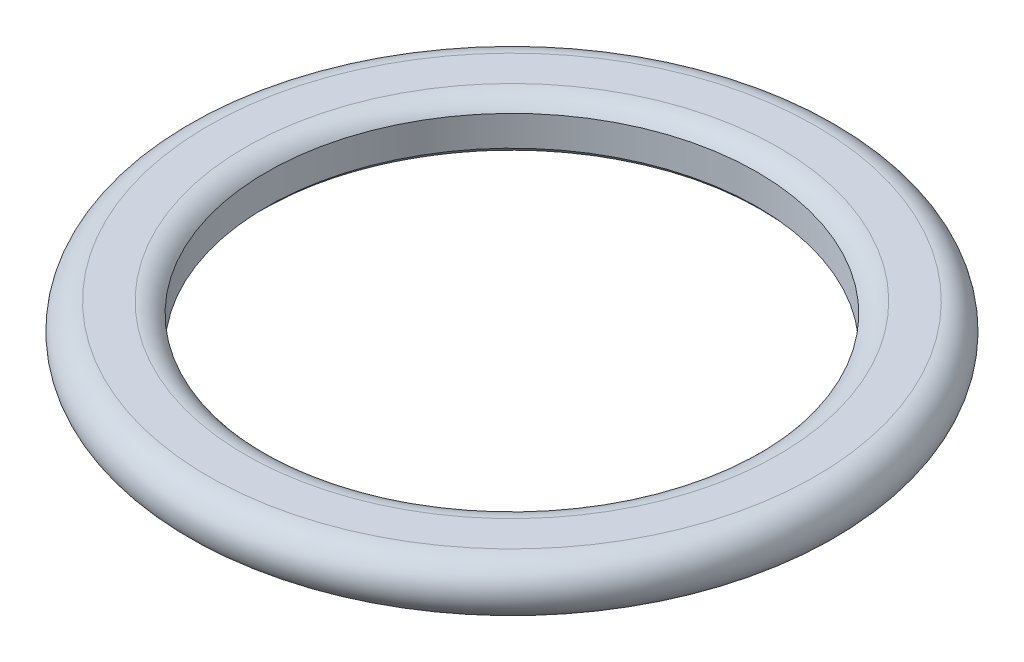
ISO-10303-21;
HEADER;
FILE_DESCRIPTION(('STEP AP214'),'2;1');
FILE_NAME('part.step','',(''),(''),'','','');
FILE_SCHEMA(('AUTOMOTIVE_DESIGN { 1 0 10303 214 1 1 1 1 }'));
ENDSEC;
DATA;
#1=APPLICATION_CONTEXT('core data for automotive mechanical design processes');
#2=APPLICATION_PROTOCOL_DEFINITION('international standard','automotive_design',2000,#1);
#3=PRODUCT_CONTEXT('',#1,'mechanical');
#4=PRODUCT('Part','Part','',(#3));
#5=PRODUCT_RELATED_PRODUCT_CATEGORY('part','',(#4));
#6=PRODUCT_DEFINITION_FORMATION('','',#4);
#7=PRODUCT_DEFINITION_CONTEXT('part definition',#1,'design');
#8=PRODUCT_DEFINITION('design','',#6,#7);
#9=PRODUCT_DEFINITION_SHAPE('','',#8);
#10=(LENGTH_UNIT() NAMED_UNIT(*) SI_UNIT(.MILLI.,.METRE.));
#11=(NAMED_UNIT(*) PLANE_ANGLE_UNIT() SI_UNIT($,.RADIAN.));
#12=(NAMED_UNIT(*) SI_UNIT($,.STERADIAN.) SOLID_ANGLE_UNIT());
#13=UNCERTAINTY_MEASURE_WITH_UNIT(LENGTH_MEASURE(1.E-05),#10,'distance_accuracy_value','');
#14=(GEOMETRIC_REPRESENTATION_CONTEXT(3) GLOBAL_UNCERTAINTY_ASSIGNED_CONTEXT((#13)) GLOBAL_UNIT_ASSIGNED_CONTEXT((#10,
#11,#12)) REPRESENTATION_CONTEXT('',''));
#15=CARTESIAN_POINT('',(0.,0.,0.));
#16=DIRECTION('',(0.,0.,1.));
#17=DIRECTION('',(1.,0.,0.));
#18=AXIS2_PLACEMENT_3D('',#15,#16,#17);
#19=CARTESIAN_POINT('',(0.,0.,0.));
#20=DIRECTION('',(0.,-1.,0.));
#21=DIRECTION('',(0.,0.,-1.));
#22=AXIS2_PLACEMENT_3D('',#19,#20,#21);
#23=TOROIDAL_SURFACE('',#22,9.895078,0.965078);
#24=CARTESIAN_POINT('',(0.,-0.559310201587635,0.));
#25=DIRECTION('',(0.,1.,0.));
#26=DIRECTION('',(0.,0.,1.));
#27=AXIS2_PLACEMENT_3D('',#24,#25,#26);
#28=CIRCLE('',#27,9.1086);
#29=CARTESIAN_POINT('',(0.,-0.559310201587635,9.1086));
#30=VERTEX_POINT('',#29);
#31=EDGE_CURVE('E18',#30,#30,#28,.T.);
#32=ORIENTED_EDGE('',*,*,#31,.T.);
#33=EDGE_LOOP('',(#32));
#34=FACE_BOUND('',#33,.T.);
#35=CARTESIAN_POINT('',(0.,-0.965078,0.));
#36=DIRECTION('',(0.,-1.,0.));
#37=DIRECTION('',(0.,0.,-1.));
#38=AXIS2_PLACEMENT_3D('',#35,#36,#37);
#39=CIRCLE('',#38,9.895078);
#40=CARTESIAN_POINT('',(0.,-0.965078,-9.895078));
#41=VERTEX_POINT('',#40);
#42=EDGE_CURVE('E23',#41,#41,#39,.T.);
#43=ORIENTED_EDGE('',*,*,#42,.T.);
#44=EDGE_LOOP('',(#43));
#45=FACE_BOUND('',#44,.T.);
#46=ADVANCED_FACE('F14',(#34,#45),#23,.T.);
#47=CARTESIAN_POINT('',(0.,0.,0.));
#48=DIRECTION('',(0.,-1.,0.));
#49=DIRECTION('',(0.,0.,-1.));
#50=AXIS2_PLACEMENT_3D('',#47,#48,#49);
#51=TOROIDAL_SURFACE('',#50,11.274766,0.965078);
#52=CARTESIAN_POINT('',(0.,-0.965078,0.));
#53=DIRECTION('',(0.,-1.,0.));
#54=DIRECTION('',(0.,0.,-1.));
#55=AXIS2_PLACEMENT_3D('',#52,#53,#54);
#56=CIRCLE('',#55,11.274766);
#57=CARTESIAN_POINT('',(0.,-0.965078,-11.274766));
#58=VERTEX_POINT('',#57);
#59=EDGE_CURVE('E10',#58,#58,#56,.T.);
#60=ORIENTED_EDGE('',*,*,#59,.F.);
#61=EDGE_LOOP('',(#60));
#62=FACE_BOUND('',#61,.T.);
#63=CARTESIAN_POINT('',(0.,0.965078,0.));
#64=DIRECTION('',(0.,-1.,0.));
#65=DIRECTION('',(0.,0.,-1.));
#66=AXIS2_PLACEMENT_3D('',#63,#64,#65);
#67=CIRCLE('',#66,11.274766);
#68=CARTESIAN_POINT('',(0.,0.965078,-11.274766));
#69=VERTEX_POINT('',#68);
#70=EDGE_CURVE('E46',#69,#69,#67,.T.);
#71=ORIENTED_EDGE('',*,*,#70,.T.);
#72=EDGE_LOOP('',(#71));
#73=FACE_BOUND('',#72,.T.);
#74=ADVANCED_FACE('F16',(#62,#73),#51,.T.);
#75=CARTESIAN_POINT('',(-11.274766,-0.965078,0.));
#76=DIRECTION('',(0.,1.,0.));
#77=DIRECTION('',(0.,0.,1.));
#78=AXIS2_PLACEMENT_3D('',#75,#76,#77);
#79=PLANE('',#78);
#80=ORIENTED_EDGE('',*,*,#42,.F.);
#81=EDGE_LOOP('',(#80));
#82=FACE_BOUND('',#81,.T.);
#83=ORIENTED_EDGE('',*,*,#59,.T.);
#84=EDGE_LOOP('',(#83));
#85=FACE_BOUND('',#84,.T.);
#86=ADVANCED_FACE('F67',(#82,#85),#79,.F.);
#87=CARTESIAN_POINT('',(0.,0.559310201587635,0.));
#88=DIRECTION('',(0.,-1.,0.));
#89=DIRECTION('',(0.,0.,-1.));
#90=AXIS2_PLACEMENT_3D('',#87,#88,#89);
#91=CIRCLE('',#90,9.1086);
#92=CARTESIAN_POINT('',(0.,0.559310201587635,-9.1086));
#93=VERTEX_POINT('',#92);
#94=EDGE_CURVE('E36',#93,#93,#91,.T.);
#95=ORIENTED_EDGE('',*,*,#94,.T.);
#96=EDGE_LOOP('',(#95));
#97=FACE_BOUND('',#96,.T.);
#98=CARTESIAN_POINT('',(0.,0.965078,0.));
#99=DIRECTION('',(0.,-1.,0.));
#100=DIRECTION('',(0.,0.,-1.));
#101=AXIS2_PLACEMENT_3D('',#98,#99,#100);
#102=CIRCLE('',#101,9.895078);
#103=CARTESIAN_POINT('',(0.,0.965078,-9.895078));
#104=VERTEX_POINT('',#103);
#105=EDGE_CURVE('E33',#104,#104,#102,.T.);
#106=ORIENTED_EDGE('',*,*,#105,.F.);
#107=EDGE_LOOP('',(#106));
#108=FACE_BOUND('',#107,.T.);
#109=ADVANCED_FACE('F65',(#97,#108),#23,.T.);
#110=CARTESIAN_POINT('',(-11.274766,0.965078,0.));
#111=DIRECTION('',(0.,1.,0.));
#112=DIRECTION('',(0.,0.,1.));
#113=AXIS2_PLACEMENT_3D('',#110,#111,#112);
#114=PLANE('',#113);
#115=ORIENTED_EDGE('',*,*,#105,.T.);
#116=EDGE_LOOP('',(#115));
#117=FACE_BOUND('',#116,.T.);
#118=ORIENTED_EDGE('',*,*,#70,.F.);
#119=EDGE_LOOP('',(#118));
#120=FACE_BOUND('',#119,.T.);
#121=ADVANCED_FACE('F62',(#117,#120),#114,.T.);
#122=CARTESIAN_POINT('',(0.,-1.930156,0.));
#123=DIRECTION('',(0.,1.,0.));
#124=DIRECTION('',(1.,0.,0.));
#125=AXIS2_PLACEMENT_3D('',#122,#123,#124);
#126=CYLINDRICAL_SURFACE('',#125,9.1086);
#127=ORIENTED_EDGE('',*,*,#94,.F.);
#128=EDGE_LOOP('',(#127));
#129=FACE_BOUND('',#128,.T.);
#130=ORIENTED_EDGE('',*,*,#31,.F.);
#131=EDGE_LOOP('',(#130));
#132=FACE_BOUND('',#131,.T.);
#133=ADVANCED_FACE('F74',(#129,#132),#126,.F.);
#134=CLOSED_SHELL('',(#46,#74,#86,#109,#121,#133));
#135=MANIFOLD_SOLID_BREP('B1',#134);
#136=ADVANCED_BREP_SHAPE_REPRESENTATION('',(#18,#135),#14);
#137=SHAPE_DEFINITION_REPRESENTATION(#9,#136);
ENDSEC;
END-ISO-10303-21;
